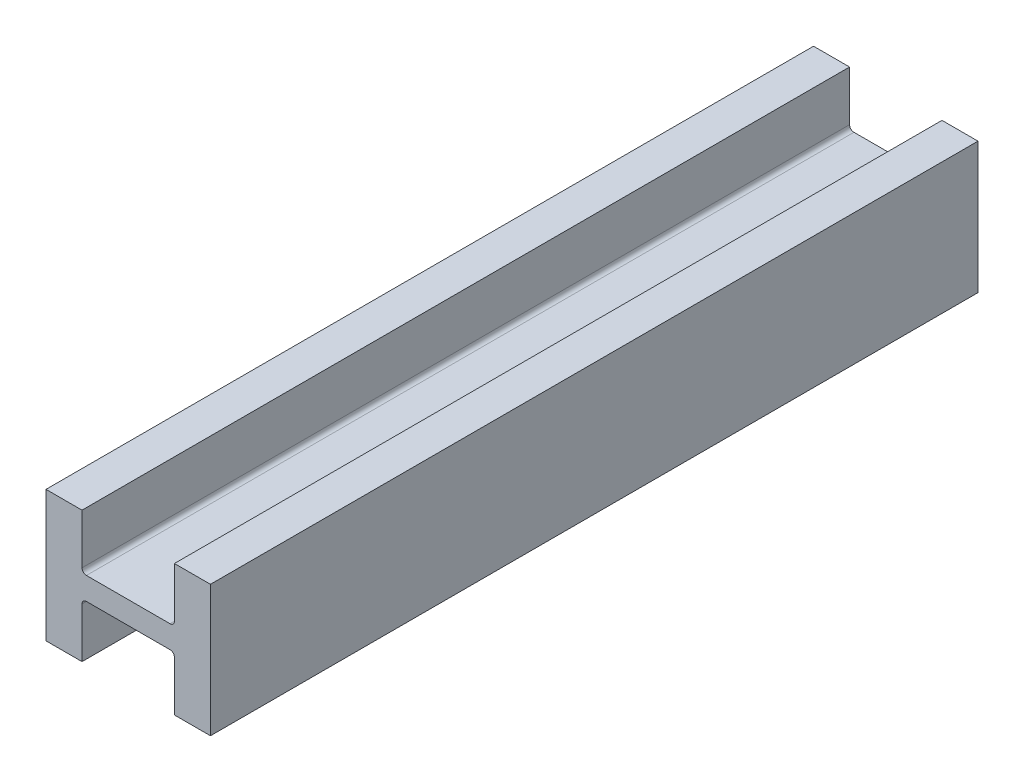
ISO-10303-21;
HEADER;
FILE_DESCRIPTION(('STEP AP214'),'2;1');
FILE_NAME('part.step','',(''),(''),'','','');
FILE_SCHEMA(('AUTOMOTIVE_DESIGN { 1 0 10303 214 1 1 1 1 }'));
ENDSEC;
DATA;
#1=APPLICATION_CONTEXT('core data for automotive mechanical design processes');
#2=APPLICATION_PROTOCOL_DEFINITION('international standard','automotive_design',2000,#1);
#3=PRODUCT_CONTEXT('',#1,'mechanical');
#4=PRODUCT('Part','Part','',(#3));
#5=PRODUCT_RELATED_PRODUCT_CATEGORY('part','',(#4));
#6=PRODUCT_DEFINITION_FORMATION('','',#4);
#7=PRODUCT_DEFINITION_CONTEXT('part definition',#1,'design');
#8=PRODUCT_DEFINITION('design','',#6,#7);
#9=PRODUCT_DEFINITION_SHAPE('','',#8);
#10=(LENGTH_UNIT() NAMED_UNIT(*) SI_UNIT(.MILLI.,.METRE.));
#11=(NAMED_UNIT(*) PLANE_ANGLE_UNIT() SI_UNIT($,.RADIAN.));
#12=(NAMED_UNIT(*) SI_UNIT($,.STERADIAN.) SOLID_ANGLE_UNIT());
#13=UNCERTAINTY_MEASURE_WITH_UNIT(LENGTH_MEASURE(1.E-05),#10,'distance_accuracy_value','');
#14=(GEOMETRIC_REPRESENTATION_CONTEXT(3) GLOBAL_UNCERTAINTY_ASSIGNED_CONTEXT((#13)) GLOBAL_UNIT_ASSIGNED_CONTEXT((#10,
#11,#12)) REPRESENTATION_CONTEXT('',''));
#15=CARTESIAN_POINT('',(0.,0.,0.));
#16=DIRECTION('',(0.,0.,1.));
#17=DIRECTION('',(1.,0.,0.));
#18=AXIS2_PLACEMENT_3D('',#15,#16,#17);
#19=CARTESIAN_POINT('',(284.733999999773,227.202999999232,1329.04999999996));
#20=DIRECTION('',(-1.,0.,0.));
#21=DIRECTION('',(0.,0.,1.));
#22=AXIS2_PLACEMENT_3D('',#19,#20,#21);
#23=PLANE('',#22);
#24=DIRECTION('',(0.,1.,0.));
#25=VECTOR('',#24,1.);
#26=CARTESIAN_POINT('',(284.733999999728,227.20300000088,-1329.04999999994));
#27=LINE('',#26,#25);
#28=CARTESIAN_POINT('',(284.733999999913,-227.20299999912,-1329.05000000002));
#29=VERTEX_POINT('',#28);
#30=CARTESIAN_POINT('',(284.733999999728,227.20300000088,-1329.04999999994));
#31=VERTEX_POINT('',#30);
#32=EDGE_CURVE('E193',#29,#31,#27,.T.);
#33=ORIENTED_EDGE('',*,*,#32,.T.);
#34=DIRECTION('',(0.,0.,-1.));
#35=VECTOR('',#34,1.);
#36=CARTESIAN_POINT('',(284.733999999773,227.202999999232,1329.04999999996));
#37=LINE('',#36,#35);
#38=CARTESIAN_POINT('',(284.733999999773,227.202999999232,1329.04999999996));
#39=VERTEX_POINT('',#38);
#40=EDGE_CURVE('E11',#39,#31,#37,.T.);
#41=ORIENTED_EDGE('',*,*,#40,.F.);
#42=DIRECTION('',(0.,1.,0.));
#43=VECTOR('',#42,1.);
#44=CARTESIAN_POINT('',(284.733999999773,227.202999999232,1329.04999999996));
#45=LINE('',#44,#43);
#46=CARTESIAN_POINT('',(284.733999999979,-227.203000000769,1329.04999999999));
#47=VERTEX_POINT('',#46);
#48=EDGE_CURVE('E243',#47,#39,#45,.T.);
#49=ORIENTED_EDGE('',*,*,#48,.F.);
#50=DIRECTION('',(0.,0.,-1.));
#51=VECTOR('',#50,1.);
#52=CARTESIAN_POINT('',(284.733999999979,-227.203000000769,1329.04999999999));
#53=LINE('',#52,#51);
#54=EDGE_CURVE('E192',#47,#29,#53,.T.);
#55=ORIENTED_EDGE('',*,*,#54,.T.);
#56=EDGE_LOOP('',(#33,#41,#49,#55));
#57=FACE_BOUND('',#56,.T.);
#58=ADVANCED_FACE('F44',(#57),#23,.F.);
#59=CARTESIAN_POINT('',(160.019999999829,227.202999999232,1329.04999999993));
#60=DIRECTION('',(0.,-1.,0.));
#61=DIRECTION('',(0.,0.,-1.));
#62=AXIS2_PLACEMENT_3D('',#59,#60,#61);
#63=PLANE('',#62);
#64=DIRECTION('',(-1.,0.,0.));
#65=VECTOR('',#64,1.);
#66=CARTESIAN_POINT('',(160.019999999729,227.20300000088,-1329.05000000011));
#67=LINE('',#66,#65);
#68=CARTESIAN_POINT('',(160.019999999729,227.20300000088,-1329.05000000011));
#69=VERTEX_POINT('',#68);
#70=EDGE_CURVE('E197',#31,#69,#67,.T.);
#71=ORIENTED_EDGE('',*,*,#70,.T.);
#72=DIRECTION('',(0.,0.,-1.));
#73=VECTOR('',#72,1.);
#74=CARTESIAN_POINT('',(160.019999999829,227.202999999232,1329.04999999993));
#75=LINE('',#74,#73);
#76=CARTESIAN_POINT('',(160.019999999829,227.202999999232,1329.04999999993));
#77=VERTEX_POINT('',#76);
#78=EDGE_CURVE('E53',#77,#69,#75,.T.);
#79=ORIENTED_EDGE('',*,*,#78,.F.);
#80=DIRECTION('',(-1.,0.,0.));
#81=VECTOR('',#80,1.);
#82=CARTESIAN_POINT('',(160.019999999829,227.202999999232,1329.04999999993));
#83=LINE('',#82,#81);
#84=EDGE_CURVE('E129',#39,#77,#83,.T.);
#85=ORIENTED_EDGE('',*,*,#84,.F.);
#86=ORIENTED_EDGE('',*,*,#40,.T.);
#87=EDGE_LOOP('',(#71,#79,#85,#86));
#88=FACE_BOUND('',#87,.T.);
#89=ADVANCED_FACE('F410',(#88),#63,.F.);
#90=CARTESIAN_POINT('',(160.019999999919,54.228999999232,1329.04999999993));
#91=DIRECTION('',(1.,0.,0.));
#92=DIRECTION('',(0.,0.,-1.));
#93=AXIS2_PLACEMENT_3D('',#90,#91,#92);
#94=PLANE('',#93);
#95=DIRECTION('',(0.,-1.,0.));
#96=VECTOR('',#95,1.);
#97=CARTESIAN_POINT('',(160.019999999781,54.2290000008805,-1329.05000000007));
#98=LINE('',#97,#96);
#99=CARTESIAN_POINT('',(160.019999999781,54.2290000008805,-1329.05000000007));
#100=VERTEX_POINT('',#99);
#101=EDGE_CURVE('E205',#69,#100,#98,.T.);
#102=ORIENTED_EDGE('',*,*,#101,.T.);
#103=DIRECTION('',(0.,0.,-1.));
#104=VECTOR('',#103,1.);
#105=CARTESIAN_POINT('',(160.019999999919,54.228999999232,1329.04999999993));
#106=LINE('',#105,#104);
#107=CARTESIAN_POINT('',(160.019999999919,54.228999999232,1329.04999999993));
#108=VERTEX_POINT('',#107);
#109=EDGE_CURVE('E281',#108,#100,#106,.T.);
#110=ORIENTED_EDGE('',*,*,#109,.F.);
#111=DIRECTION('',(0.,-1.,0.));
#112=VECTOR('',#111,1.);
#113=CARTESIAN_POINT('',(160.019999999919,54.228999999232,1329.04999999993));
#114=LINE('',#113,#112);
#115=EDGE_CURVE('E293',#77,#108,#114,.T.);
#116=ORIENTED_EDGE('',*,*,#115,.F.);
#117=ORIENTED_EDGE('',*,*,#78,.T.);
#118=EDGE_LOOP('',(#102,#110,#116,#117));
#119=FACE_BOUND('',#118,.T.);
#120=ADVANCED_FACE('F291',(#119),#94,.F.);
#121=CARTESIAN_POINT('',(144.779999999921,54.2289999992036,1329.05000000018));
#122=DIRECTION('',(0.,0.,-1.));
#123=DIRECTION('',(-1.,0.,0.));
#124=AXIS2_PLACEMENT_3D('',#121,#122,#123);
#125=CYLINDRICAL_SURFACE('',#124,15.24);
#126=CARTESIAN_POINT('',(144.779999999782,54.2290000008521,-1329.04999999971));
#127=DIRECTION('',(0.,0.,-1.));
#128=DIRECTION('',(1.,0.,0.));
#129=AXIS2_PLACEMENT_3D('',#126,#127,#128);
#130=CIRCLE('',#129,15.24);
#131=CARTESIAN_POINT('',(144.779999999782,38.9890000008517,-1329.05000000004));
#132=VERTEX_POINT('',#131);
#133=EDGE_CURVE('E203',#100,#132,#130,.T.);
#134=ORIENTED_EDGE('',*,*,#133,.T.);
#135=DIRECTION('',(0.,0.,-1.));
#136=VECTOR('',#135,1.);
#137=CARTESIAN_POINT('',(144.779999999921,38.9889999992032,1329.04999999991));
#138=LINE('',#137,#136);
#139=CARTESIAN_POINT('',(144.779999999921,38.9889999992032,1329.04999999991));
#140=VERTEX_POINT('',#139);
#141=EDGE_CURVE('E279',#140,#132,#138,.T.);
#142=ORIENTED_EDGE('',*,*,#141,.F.);
#143=CARTESIAN_POINT('',(144.779999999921,54.2289999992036,1329.05000000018));
#144=DIRECTION('',(0.,0.,-1.));
#145=DIRECTION('',(1.,0.,0.));
#146=AXIS2_PLACEMENT_3D('',#143,#144,#145);
#147=CIRCLE('',#146,15.24);
#148=EDGE_CURVE('E312',#108,#140,#147,.T.);
#149=ORIENTED_EDGE('',*,*,#148,.F.);
#150=ORIENTED_EDGE('',*,*,#109,.T.);
#151=EDGE_LOOP('',(#134,#142,#149,#150));
#152=FACE_BOUND('',#151,.T.);
#153=ADVANCED_FACE('F305',(#152),#125,.F.);
#154=CARTESIAN_POINT('',(-144.780000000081,38.9889999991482,1329.05000000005));
#155=DIRECTION('',(0.,-1.,0.));
#156=DIRECTION('',(0.,0.,-1.));
#157=AXIS2_PLACEMENT_3D('',#154,#155,#156);
#158=PLANE('',#157);
#159=DIRECTION('',(-1.,0.,0.));
#160=VECTOR('',#159,1.);
#161=CARTESIAN_POINT('',(-144.780000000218,38.9890000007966,-1329.04999999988));
#162=LINE('',#161,#160);
#163=CARTESIAN_POINT('',(-144.780000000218,38.9890000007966,-1329.04999999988));
#164=VERTEX_POINT('',#163);
#165=EDGE_CURVE('E206',#132,#164,#162,.T.);
#166=ORIENTED_EDGE('',*,*,#165,.T.);
#167=DIRECTION('',(0.,0.,-1.));
#168=VECTOR('',#167,1.);
#169=CARTESIAN_POINT('',(-144.780000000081,38.9889999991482,1329.05000000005));
#170=LINE('',#169,#168);
#171=CARTESIAN_POINT('',(-144.780000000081,38.9889999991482,1329.05000000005));
#172=VERTEX_POINT('',#171);
#173=EDGE_CURVE('E276',#172,#164,#170,.T.);
#174=ORIENTED_EDGE('',*,*,#173,.F.);
#175=DIRECTION('',(-1.,0.,0.));
#176=VECTOR('',#175,1.);
#177=CARTESIAN_POINT('',(-144.780000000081,38.9889999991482,1329.05000000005));
#178=LINE('',#177,#176);
#179=EDGE_CURVE('E307',#140,#172,#178,.T.);
#180=ORIENTED_EDGE('',*,*,#179,.F.);
#181=ORIENTED_EDGE('',*,*,#141,.T.);
#182=EDGE_LOOP('',(#166,#174,#180,#181));
#183=FACE_BOUND('',#182,.T.);
#184=ADVANCED_FACE('F306',(#183),#158,.F.);
#185=CARTESIAN_POINT('',(-144.780000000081,54.2289999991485,1329.05));
#186=DIRECTION('',(0.,0.,-1.));
#187=DIRECTION('',(-1.,0.,0.));
#188=AXIS2_PLACEMENT_3D('',#185,#186,#187);
#189=CYLINDRICAL_SURFACE('',#188,15.24);
#190=CARTESIAN_POINT('',(-144.780000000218,54.229000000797,-1329.0499999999));
#191=DIRECTION('',(0.,0.,-1.));
#192=DIRECTION('',(1.,0.,0.));
#193=AXIS2_PLACEMENT_3D('',#190,#191,#192);
#194=CIRCLE('',#193,15.24);
#195=CARTESIAN_POINT('',(-160.020000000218,54.229000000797,-1329.04999999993));
#196=VERTEX_POINT('',#195);
#197=EDGE_CURVE('E213',#164,#196,#194,.T.);
#198=ORIENTED_EDGE('',*,*,#197,.T.);
#199=DIRECTION('',(0.,0.,-1.));
#200=VECTOR('',#199,1.);
#201=CARTESIAN_POINT('',(-160.020000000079,54.2289999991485,1329.04999999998));
#202=LINE('',#201,#200);
#203=CARTESIAN_POINT('',(-160.020000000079,54.2289999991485,1329.04999999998));
#204=VERTEX_POINT('',#203);
#205=EDGE_CURVE('E275',#204,#196,#202,.T.);
#206=ORIENTED_EDGE('',*,*,#205,.F.);
#207=CARTESIAN_POINT('',(-144.780000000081,54.2289999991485,1329.05));
#208=DIRECTION('',(0.,0.,-1.));
#209=DIRECTION('',(1.,0.,0.));
#210=AXIS2_PLACEMENT_3D('',#207,#208,#209);
#211=CIRCLE('',#210,15.24);
#212=EDGE_CURVE('E313',#172,#204,#211,.T.);
#213=ORIENTED_EDGE('',*,*,#212,.F.);
#214=ORIENTED_EDGE('',*,*,#173,.T.);
#215=EDGE_LOOP('',(#198,#206,#213,#214));
#216=FACE_BOUND('',#215,.T.);
#217=ADVANCED_FACE('F418',(#216),#189,.F.);
#218=CARTESIAN_POINT('',(-160.02000000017,227.202999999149,1329.04999999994));
#219=DIRECTION('',(-1.,0.,0.));
#220=DIRECTION('',(0.,0.,1.));
#221=AXIS2_PLACEMENT_3D('',#218,#219,#220);
#222=PLANE('',#221);
#223=DIRECTION('',(0.,1.,0.));
#224=VECTOR('',#223,1.);
#225=CARTESIAN_POINT('',(-160.020000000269,227.203000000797,-1329.04999999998));
#226=LINE('',#225,#224);
#227=CARTESIAN_POINT('',(-160.020000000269,227.203000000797,-1329.04999999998));
#228=VERTEX_POINT('',#227);
#229=EDGE_CURVE('E215',#196,#228,#226,.T.);
#230=ORIENTED_EDGE('',*,*,#229,.T.);
#231=DIRECTION('',(0.,0.,-1.));
#232=VECTOR('',#231,1.);
#233=CARTESIAN_POINT('',(-160.02000000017,227.202999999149,1329.04999999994));
#234=LINE('',#233,#232);
#235=CARTESIAN_POINT('',(-160.02000000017,227.202999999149,1329.04999999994));
#236=VERTEX_POINT('',#235);
#237=EDGE_CURVE('E268',#236,#228,#234,.T.);
#238=ORIENTED_EDGE('',*,*,#237,.F.);
#239=DIRECTION('',(0.,1.,0.));
#240=VECTOR('',#239,1.);
#241=CARTESIAN_POINT('',(-160.02000000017,227.202999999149,1329.04999999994));
#242=LINE('',#241,#240);
#243=EDGE_CURVE('E317',#204,#236,#242,.T.);
#244=ORIENTED_EDGE('',*,*,#243,.F.);
#245=ORIENTED_EDGE('',*,*,#205,.T.);
#246=EDGE_LOOP('',(#230,#238,#244,#245));
#247=FACE_BOUND('',#246,.T.);
#248=ADVANCED_FACE('F421',(#247),#222,.F.);
#249=CARTESIAN_POINT('',(-284.734000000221,227.202999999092,1329.04999999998));
#250=DIRECTION('',(0.,-1.,0.));
#251=DIRECTION('',(0.,0.,-1.));
#252=AXIS2_PLACEMENT_3D('',#249,#250,#251);
#253=PLANE('',#252);
#254=DIRECTION('',(-1.,0.,0.));
#255=VECTOR('',#254,1.);
#256=CARTESIAN_POINT('',(-284.73400000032,227.20300000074,-1329.04999999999));
#257=LINE('',#256,#255);
#258=CARTESIAN_POINT('',(-284.73400000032,227.20300000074,-1329.04999999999));
#259=VERTEX_POINT('',#258);
#260=EDGE_CURVE('E220',#228,#259,#257,.T.);
#261=ORIENTED_EDGE('',*,*,#260,.T.);
#262=DIRECTION('',(0.,0.,-1.));
#263=VECTOR('',#262,1.);
#264=CARTESIAN_POINT('',(-284.734000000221,227.202999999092,1329.04999999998));
#265=LINE('',#264,#263);
#266=CARTESIAN_POINT('',(-284.734000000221,227.202999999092,1329.04999999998));
#267=VERTEX_POINT('',#266);
#268=EDGE_CURVE('E264',#267,#259,#265,.T.);
#269=ORIENTED_EDGE('',*,*,#268,.F.);
#270=DIRECTION('',(-1.,0.,0.));
#271=VECTOR('',#270,1.);
#272=CARTESIAN_POINT('',(-284.734000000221,227.202999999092,1329.04999999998));
#273=LINE('',#272,#271);
#274=EDGE_CURVE('E327',#236,#267,#273,.T.);
#275=ORIENTED_EDGE('',*,*,#274,.F.);
#276=ORIENTED_EDGE('',*,*,#237,.T.);
#277=EDGE_LOOP('',(#261,#269,#275,#276));
#278=FACE_BOUND('',#277,.T.);
#279=ADVANCED_FACE('F430',(#278),#253,.F.);
#280=CARTESIAN_POINT('',(-284.733999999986,-227.203000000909,1329.04999999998));
#281=DIRECTION('',(1.,0.,0.));
#282=DIRECTION('',(0.,0.,-1.));
#283=AXIS2_PLACEMENT_3D('',#280,#281,#282);
#284=PLANE('',#283);
#285=DIRECTION('',(0.,-1.,0.));
#286=VECTOR('',#285,1.);
#287=CARTESIAN_POINT('',(-284.734000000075,-227.20299999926,-1329.05000000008));
#288=LINE('',#287,#286);
#289=CARTESIAN_POINT('',(-284.734000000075,-227.20299999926,-1329.05000000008));
#290=VERTEX_POINT('',#289);
#291=EDGE_CURVE('E217',#259,#290,#288,.T.);
#292=ORIENTED_EDGE('',*,*,#291,.T.);
#293=DIRECTION('',(0.,0.,-1.));
#294=VECTOR('',#293,1.);
#295=CARTESIAN_POINT('',(-284.733999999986,-227.203000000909,1329.04999999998));
#296=LINE('',#295,#294);
#297=CARTESIAN_POINT('',(-284.733999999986,-227.203000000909,1329.04999999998));
#298=VERTEX_POINT('',#297);
#299=EDGE_CURVE('E259',#298,#290,#296,.T.);
#300=ORIENTED_EDGE('',*,*,#299,.F.);
#301=DIRECTION('',(0.,-1.,0.));
#302=VECTOR('',#301,1.);
#303=CARTESIAN_POINT('',(-284.733999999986,-227.203000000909,1329.04999999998));
#304=LINE('',#303,#302);
#305=EDGE_CURVE('E326',#267,#298,#304,.T.);
#306=ORIENTED_EDGE('',*,*,#305,.F.);
#307=ORIENTED_EDGE('',*,*,#268,.T.);
#308=EDGE_LOOP('',(#292,#300,#306,#307));
#309=FACE_BOUND('',#308,.T.);
#310=ADVANCED_FACE('F433',(#309),#284,.F.);
#311=CARTESIAN_POINT('',(-160.0199999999,-227.203000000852,1329.05000000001));
#312=DIRECTION('',(0.,1.,0.));
#313=DIRECTION('',(0.,0.,1.));
#314=AXIS2_PLACEMENT_3D('',#311,#312,#313);
#315=PLANE('',#314);
#316=DIRECTION('',(1.,0.,0.));
#317=VECTOR('',#316,1.);
#318=CARTESIAN_POINT('',(-160.019999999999,-227.202999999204,-1329.04999999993));
#319=LINE('',#318,#317);
#320=CARTESIAN_POINT('',(-160.019999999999,-227.202999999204,-1329.04999999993));
#321=VERTEX_POINT('',#320);
#322=EDGE_CURVE('E223',#290,#321,#319,.T.);
#323=ORIENTED_EDGE('',*,*,#322,.T.);
#324=DIRECTION('',(0.,0.,-1.));
#325=VECTOR('',#324,1.);
#326=CARTESIAN_POINT('',(-160.0199999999,-227.203000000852,1329.05000000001));
#327=LINE('',#326,#325);
#328=CARTESIAN_POINT('',(-160.0199999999,-227.203000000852,1329.05000000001));
#329=VERTEX_POINT('',#328);
#330=EDGE_CURVE('E258',#329,#321,#327,.T.);
#331=ORIENTED_EDGE('',*,*,#330,.F.);
#332=DIRECTION('',(1.,0.,0.));
#333=VECTOR('',#332,1.);
#334=CARTESIAN_POINT('',(-160.0199999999,-227.203000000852,1329.05000000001));
#335=LINE('',#334,#333);
#336=EDGE_CURVE('E335',#298,#329,#335,.T.);
#337=ORIENTED_EDGE('',*,*,#336,.F.);
#338=ORIENTED_EDGE('',*,*,#299,.T.);
#339=EDGE_LOOP('',(#323,#331,#337,#338));
#340=FACE_BOUND('',#339,.T.);
#341=ADVANCED_FACE('F434',(#340),#315,.F.);
#342=CARTESIAN_POINT('',(-160.020000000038,-54.2290000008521,1329.05000000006));
#343=DIRECTION('',(-1.,0.,0.));
#344=DIRECTION('',(0.,0.,1.));
#345=AXIS2_PLACEMENT_3D('',#342,#343,#344);
#346=PLANE('',#345);
#347=DIRECTION('',(0.,1.,0.));
#348=VECTOR('',#347,1.);
#349=CARTESIAN_POINT('',(-160.020000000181,-54.2289999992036,-1329.04999999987));
#350=LINE('',#349,#348);
#351=CARTESIAN_POINT('',(-160.020000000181,-54.2289999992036,-1329.04999999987));
#352=VERTEX_POINT('',#351);
#353=EDGE_CURVE('E226',#321,#352,#350,.T.);
#354=ORIENTED_EDGE('',*,*,#353,.T.);
#355=DIRECTION('',(0.,0.,-1.));
#356=VECTOR('',#355,1.);
#357=CARTESIAN_POINT('',(-160.020000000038,-54.2290000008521,1329.05000000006));
#358=LINE('',#357,#356);
#359=CARTESIAN_POINT('',(-160.020000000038,-54.2290000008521,1329.05000000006));
#360=VERTEX_POINT('',#359);
#361=EDGE_CURVE('E255',#360,#352,#358,.T.);
#362=ORIENTED_EDGE('',*,*,#361,.F.);
#363=DIRECTION('',(0.,1.,0.));
#364=VECTOR('',#363,1.);
#365=CARTESIAN_POINT('',(-160.020000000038,-54.2290000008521,1329.05000000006));
#366=LINE('',#365,#364);
#367=EDGE_CURVE('E334',#329,#360,#366,.T.);
#368=ORIENTED_EDGE('',*,*,#367,.F.);
#369=ORIENTED_EDGE('',*,*,#330,.T.);
#370=EDGE_LOOP('',(#354,#362,#368,#369));
#371=FACE_BOUND('',#370,.T.);
#372=ADVANCED_FACE('F440',(#371),#346,.F.);
#373=CARTESIAN_POINT('',(-144.78000000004,-54.2290000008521,1329.04999999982));
#374=DIRECTION('',(0.,0.,-1.));
#375=DIRECTION('',(-1.,0.,0.));
#376=AXIS2_PLACEMENT_3D('',#373,#374,#375);
#377=CYLINDRICAL_SURFACE('',#376,15.24);
#378=CARTESIAN_POINT('',(-144.78000000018,-54.2289999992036,-1329.05000000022));
#379=DIRECTION('',(0.,0.,-1.));
#380=DIRECTION('',(1.,0.,0.));
#381=AXIS2_PLACEMENT_3D('',#378,#379,#380);
#382=CIRCLE('',#381,15.24);
#383=CARTESIAN_POINT('',(-144.780000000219,-38.9889999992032,-1329.04999999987));
#384=VERTEX_POINT('',#383);
#385=EDGE_CURVE('E227',#352,#384,#382,.T.);
#386=ORIENTED_EDGE('',*,*,#385,.T.);
#387=DIRECTION('',(0.,0.,-1.));
#388=VECTOR('',#387,1.);
#389=CARTESIAN_POINT('',(-144.780000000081,-38.9890000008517,1329.05000000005));
#390=LINE('',#389,#388);
#391=CARTESIAN_POINT('',(-144.780000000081,-38.9890000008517,1329.05000000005));
#392=VERTEX_POINT('',#391);
#393=EDGE_CURVE('E246',#392,#384,#390,.T.);
#394=ORIENTED_EDGE('',*,*,#393,.F.);
#395=CARTESIAN_POINT('',(-144.78000000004,-54.2290000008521,1329.04999999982));
#396=DIRECTION('',(0.,0.,-1.));
#397=DIRECTION('',(1.,0.,0.));
#398=AXIS2_PLACEMENT_3D('',#395,#396,#397);
#399=CIRCLE('',#398,15.24);
#400=EDGE_CURVE('E336',#360,#392,#399,.T.);
#401=ORIENTED_EDGE('',*,*,#400,.F.);
#402=ORIENTED_EDGE('',*,*,#361,.T.);
#403=EDGE_LOOP('',(#386,#394,#401,#402));
#404=FACE_BOUND('',#403,.T.);
#405=ADVANCED_FACE('F441',(#404),#377,.F.);
#406=CARTESIAN_POINT('',(144.779999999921,-38.9890000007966,1329.04999999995));
#407=DIRECTION('',(0.,1.,0.));
#408=DIRECTION('',(-1.,0.,0.));
#409=AXIS2_PLACEMENT_3D('',#406,#407,#408);
#410=PLANE('',#409);
#411=DIRECTION('',(1.,0.,0.));
#412=VECTOR('',#411,1.);
#413=CARTESIAN_POINT('',(144.779999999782,-38.9889999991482,-1329.05000000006));
#414=LINE('',#413,#412);
#415=CARTESIAN_POINT('',(144.779999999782,-38.9889999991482,-1329.05000000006));
#416=VERTEX_POINT('',#415);
#417=EDGE_CURVE('E235',#384,#416,#414,.T.);
#418=ORIENTED_EDGE('',*,*,#417,.T.);
#419=DIRECTION('',(0.,0.,-1.));
#420=VECTOR('',#419,1.);
#421=CARTESIAN_POINT('',(144.779999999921,-38.9890000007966,1329.04999999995));
#422=LINE('',#421,#420);
#423=CARTESIAN_POINT('',(144.779999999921,-38.9890000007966,1329.04999999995));
#424=VERTEX_POINT('',#423);
#425=EDGE_CURVE('E183',#424,#416,#422,.T.);
#426=ORIENTED_EDGE('',*,*,#425,.F.);
#427=DIRECTION('',(1.,0.,0.));
#428=VECTOR('',#427,1.);
#429=CARTESIAN_POINT('',(144.779999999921,-38.9890000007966,1329.04999999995));
#430=LINE('',#429,#428);
#431=EDGE_CURVE('E175',#392,#424,#430,.T.);
#432=ORIENTED_EDGE('',*,*,#431,.F.);
#433=ORIENTED_EDGE('',*,*,#393,.T.);
#434=EDGE_LOOP('',(#418,#426,#432,#433));
#435=FACE_BOUND('',#434,.T.);
#436=ADVANCED_FACE('F450',(#435),#410,.F.);
#437=CARTESIAN_POINT('',(144.779999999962,-54.229000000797,1329.04999999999));
#438=DIRECTION('',(0.,0.,-1.));
#439=DIRECTION('',(-1.,0.,0.));
#440=AXIS2_PLACEMENT_3D('',#437,#438,#439);
#441=CYLINDRICAL_SURFACE('',#440,15.24);
#442=CARTESIAN_POINT('',(144.77999999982,-54.2289999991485,-1329.05000000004));
#443=DIRECTION('',(0.,0.,-1.));
#444=DIRECTION('',(1.,0.,0.));
#445=AXIS2_PLACEMENT_3D('',#442,#443,#444);
#446=CIRCLE('',#445,15.24);
#447=CARTESIAN_POINT('',(160.019999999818,-54.2289999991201,-1329.05000000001));
#448=VERTEX_POINT('',#447);
#449=EDGE_CURVE('E181',#416,#448,#446,.T.);
#450=ORIENTED_EDGE('',*,*,#449,.T.);
#451=DIRECTION('',(0.,0.,-1.));
#452=VECTOR('',#451,1.);
#453=CARTESIAN_POINT('',(160.01999999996,-54.2290000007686,1329.05000000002));
#454=LINE('',#453,#452);
#455=CARTESIAN_POINT('',(160.01999999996,-54.2290000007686,1329.05000000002));
#456=VERTEX_POINT('',#455);
#457=EDGE_CURVE('E178',#456,#448,#454,.T.);
#458=ORIENTED_EDGE('',*,*,#457,.F.);
#459=CARTESIAN_POINT('',(144.779999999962,-54.229000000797,1329.04999999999));
#460=DIRECTION('',(0.,0.,-1.));
#461=DIRECTION('',(1.,0.,0.));
#462=AXIS2_PLACEMENT_3D('',#459,#460,#461);
#463=CIRCLE('',#462,15.24);
#464=EDGE_CURVE('E168',#424,#456,#463,.T.);
#465=ORIENTED_EDGE('',*,*,#464,.F.);
#466=ORIENTED_EDGE('',*,*,#425,.T.);
#467=EDGE_LOOP('',(#450,#458,#465,#466));
#468=FACE_BOUND('',#467,.T.);
#469=ADVANCED_FACE('F177',(#468),#441,.F.);
#470=CARTESIAN_POINT('',(160.020000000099,-227.203000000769,1329.04999999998));
#471=DIRECTION('',(1.,0.,0.));
#472=DIRECTION('',(0.,0.,-1.));
#473=AXIS2_PLACEMENT_3D('',#470,#471,#472);
#474=PLANE('',#473);
#475=DIRECTION('',(0.,-1.,0.));
#476=VECTOR('',#475,1.);
#477=CARTESIAN_POINT('',(160.019999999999,-227.20299999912,-1329.05000000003));
#478=LINE('',#477,#476);
#479=CARTESIAN_POINT('',(160.019999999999,-227.20299999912,-1329.05000000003));
#480=VERTEX_POINT('',#479);
#481=EDGE_CURVE('E113',#448,#480,#478,.T.);
#482=ORIENTED_EDGE('',*,*,#481,.T.);
#483=DIRECTION('',(0.,0.,-1.));
#484=VECTOR('',#483,1.);
#485=CARTESIAN_POINT('',(160.020000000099,-227.203000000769,1329.04999999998));
#486=LINE('',#485,#484);
#487=CARTESIAN_POINT('',(160.020000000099,-227.203000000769,1329.04999999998));
#488=VERTEX_POINT('',#487);
#489=EDGE_CURVE('E182',#488,#480,#486,.T.);
#490=ORIENTED_EDGE('',*,*,#489,.F.);
#491=DIRECTION('',(0.,-1.,0.));
#492=VECTOR('',#491,1.);
#493=CARTESIAN_POINT('',(160.020000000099,-227.203000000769,1329.04999999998));
#494=LINE('',#493,#492);
#495=EDGE_CURVE('E169',#456,#488,#494,.T.);
#496=ORIENTED_EDGE('',*,*,#495,.F.);
#497=ORIENTED_EDGE('',*,*,#457,.T.);
#498=EDGE_LOOP('',(#482,#490,#496,#497));
#499=FACE_BOUND('',#498,.T.);
#500=ADVANCED_FACE('F186',(#499),#474,.F.);
#501=CARTESIAN_POINT('',(284.733999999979,-227.203000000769,1329.04999999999));
#502=DIRECTION('',(0.,1.,0.));
#503=DIRECTION('',(0.,0.,1.));
#504=AXIS2_PLACEMENT_3D('',#501,#502,#503);
#505=PLANE('',#504);
#506=DIRECTION('',(1.,0.,0.));
#507=VECTOR('',#506,1.);
#508=CARTESIAN_POINT('',(284.733999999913,-227.20299999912,-1329.05000000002));
#509=LINE('',#508,#507);
#510=EDGE_CURVE('E123',#480,#29,#509,.T.);
#511=ORIENTED_EDGE('',*,*,#510,.T.);
#512=ORIENTED_EDGE('',*,*,#54,.F.);
#513=DIRECTION('',(1.,0.,0.));
#514=VECTOR('',#513,1.);
#515=CARTESIAN_POINT('',(284.733999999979,-227.203000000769,1329.04999999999));
#516=LINE('',#515,#514);
#517=EDGE_CURVE('E65',#488,#47,#516,.T.);
#518=ORIENTED_EDGE('',*,*,#517,.F.);
#519=ORIENTED_EDGE('',*,*,#489,.T.);
#520=EDGE_LOOP('',(#511,#512,#518,#519));
#521=FACE_BOUND('',#520,.T.);
#522=ADVANCED_FACE('F456',(#521),#505,.F.);
#523=CARTESIAN_POINT('',(144.779999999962,-54.229000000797,1329.04999999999));
#524=DIRECTION('',(0.,0.,1.));
#525=DIRECTION('',(1.,0.,0.));
#526=AXIS2_PLACEMENT_3D('',#523,#524,#525);
#527=PLANE('',#526);
#528=ORIENTED_EDGE('',*,*,#48,.T.);
#529=ORIENTED_EDGE('',*,*,#84,.T.);
#530=ORIENTED_EDGE('',*,*,#115,.T.);
#531=ORIENTED_EDGE('',*,*,#148,.T.);
#532=ORIENTED_EDGE('',*,*,#179,.T.);
#533=ORIENTED_EDGE('',*,*,#212,.T.);
#534=ORIENTED_EDGE('',*,*,#243,.T.);
#535=ORIENTED_EDGE('',*,*,#274,.T.);
#536=ORIENTED_EDGE('',*,*,#305,.T.);
#537=ORIENTED_EDGE('',*,*,#336,.T.);
#538=ORIENTED_EDGE('',*,*,#367,.T.);
#539=ORIENTED_EDGE('',*,*,#400,.T.);
#540=ORIENTED_EDGE('',*,*,#431,.T.);
#541=ORIENTED_EDGE('',*,*,#464,.T.);
#542=ORIENTED_EDGE('',*,*,#495,.T.);
#543=ORIENTED_EDGE('',*,*,#517,.T.);
#544=EDGE_LOOP('',(#528,#529,#530,#531,#532,#533,#534,#535,#536,#537,#538,#539,#540,#541,#542,#543));
#545=FACE_BOUND('',#544,.T.);
#546=ADVANCED_FACE('F166',(#545),#527,.T.);
#547=CARTESIAN_POINT('',(144.77999999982,-54.2289999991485,-1329.05000000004));
#548=DIRECTION('',(0.,0.,1.));
#549=DIRECTION('',(1.,0.,0.));
#550=AXIS2_PLACEMENT_3D('',#547,#548,#549);
#551=PLANE('',#550);
#552=ORIENTED_EDGE('',*,*,#32,.F.);
#553=ORIENTED_EDGE('',*,*,#510,.F.);
#554=ORIENTED_EDGE('',*,*,#481,.F.);
#555=ORIENTED_EDGE('',*,*,#449,.F.);
#556=ORIENTED_EDGE('',*,*,#417,.F.);
#557=ORIENTED_EDGE('',*,*,#385,.F.);
#558=ORIENTED_EDGE('',*,*,#353,.F.);
#559=ORIENTED_EDGE('',*,*,#322,.F.);
#560=ORIENTED_EDGE('',*,*,#291,.F.);
#561=ORIENTED_EDGE('',*,*,#260,.F.);
#562=ORIENTED_EDGE('',*,*,#229,.F.);
#563=ORIENTED_EDGE('',*,*,#197,.F.);
#564=ORIENTED_EDGE('',*,*,#165,.F.);
#565=ORIENTED_EDGE('',*,*,#133,.F.);
#566=ORIENTED_EDGE('',*,*,#101,.F.);
#567=ORIENTED_EDGE('',*,*,#70,.F.);
#568=EDGE_LOOP('',(#552,#553,#554,#555,#556,#557,#558,#559,#560,#561,#562,#563,#564,#565,#566,#567));
#569=FACE_BOUND('',#568,.T.);
#570=ADVANCED_FACE('F297',(#569),#551,.F.);
#571=CLOSED_SHELL('',(#58,#89,#120,#153,#184,#217,#248,#279,#310,#341,#372,#405,#436,#469,#500,
#522,#546,#570));
#572=MANIFOLD_SOLID_BREP('B2',#571);
#573=ADVANCED_BREP_SHAPE_REPRESENTATION('',(#18,#572),#14);
#574=SHAPE_DEFINITION_REPRESENTATION(#9,#573);
ENDSEC;
END-ISO-10303-21;
